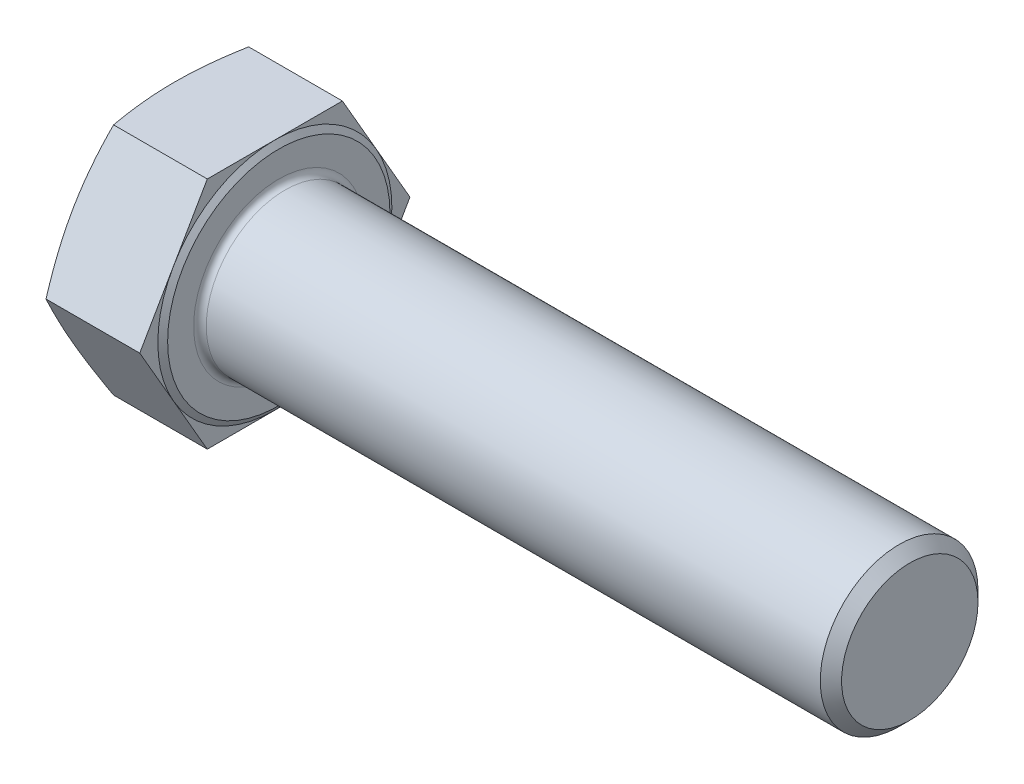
ISO-10303-21;
HEADER;
FILE_DESCRIPTION(('STEP AP214'),'2;1');
FILE_NAME('part.step','',(''),(''),'','','');
FILE_SCHEMA(('AUTOMOTIVE_DESIGN { 1 0 10303 214 1 1 1 1 }'));
ENDSEC;
DATA;
#1=APPLICATION_CONTEXT('core data for automotive mechanical design processes');
#2=APPLICATION_PROTOCOL_DEFINITION('international standard','automotive_design',2000,#1);
#3=PRODUCT_CONTEXT('',#1,'mechanical');
#4=PRODUCT('Part','Part','',(#3));
#5=PRODUCT_RELATED_PRODUCT_CATEGORY('part','',(#4));
#6=PRODUCT_DEFINITION_FORMATION('','',#4);
#7=PRODUCT_DEFINITION_CONTEXT('part definition',#1,'design');
#8=PRODUCT_DEFINITION('design','',#6,#7);
#9=PRODUCT_DEFINITION_SHAPE('','',#8);
#10=(LENGTH_UNIT() NAMED_UNIT(*) SI_UNIT(.MILLI.,.METRE.));
#11=(NAMED_UNIT(*) PLANE_ANGLE_UNIT() SI_UNIT($,.RADIAN.));
#12=(NAMED_UNIT(*) SI_UNIT($,.STERADIAN.) SOLID_ANGLE_UNIT());
#13=UNCERTAINTY_MEASURE_WITH_UNIT(LENGTH_MEASURE(1.E-05),#10,'distance_accuracy_value','');
#14=(GEOMETRIC_REPRESENTATION_CONTEXT(3) GLOBAL_UNCERTAINTY_ASSIGNED_CONTEXT((#13)) GLOBAL_UNIT_ASSIGNED_CONTEXT((#10,
#11,#12)) REPRESENTATION_CONTEXT('',''));
#15=CARTESIAN_POINT('',(0.,0.,0.));
#16=DIRECTION('',(0.,0.,1.));
#17=DIRECTION('',(1.,0.,0.));
#18=AXIS2_PLACEMENT_3D('',#15,#16,#17);
#19=CARTESIAN_POINT('',(13.22,0.,0.));
#20=DIRECTION('',(1.,0.,0.));
#21=DIRECTION('',(0.,0.,-1.));
#22=AXIS2_PLACEMENT_3D('',#19,#20,#21);
#23=PLANE('',#22);
#24=CARTESIAN_POINT('',(13.22,0.,0.));
#25=DIRECTION('',(1.,0.,0.));
#26=DIRECTION('',(0.,0.,-1.));
#27=AXIS2_PLACEMENT_3D('',#24,#25,#26);
#28=CIRCLE('',#27,10.8);
#29=CARTESIAN_POINT('',(13.22,0.,-10.8));
#30=VERTEX_POINT('',#29);
#31=EDGE_CURVE('E188',#30,#30,#28,.F.);
#32=ORIENTED_EDGE('',*,*,#31,.T.);
#33=EDGE_LOOP('',(#32));
#34=FACE_BOUND('',#33,.T.);
#35=CARTESIAN_POINT('',(13.22,0.,0.));
#36=DIRECTION('',(-1.,0.,0.));
#37=DIRECTION('',(0.,0.,1.));
#38=AXIS2_PLACEMENT_3D('',#35,#36,#37);
#39=CIRCLE('',#38,14.095);
#40=CARTESIAN_POINT('',(13.22,0.,14.095));
#41=VERTEX_POINT('',#40);
#42=EDGE_CURVE('E139',#41,#41,#39,.T.);
#43=ORIENTED_EDGE('',*,*,#42,.F.);
#44=EDGE_LOOP('',(#43));
#45=FACE_BOUND('',#44,.T.);
#46=ADVANCED_FACE('F33',(#34,#45),#23,.T.);
#47=CARTESIAN_POINT('',(12.72,0.,-17.1299824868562));
#48=DIRECTION('',(1.,0.,0.));
#49=DIRECTION('',(0.,0.,-1.));
#50=AXIS2_PLACEMENT_3D('',#47,#48,#49);
#51=PLANE('',#50);
#52=DIRECTION('',(0.,-0.866025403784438,0.5));
#53=VECTOR('',#52,1.);
#54=CARTESIAN_POINT('',(12.72,14.835,8.56499124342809));
#55=LINE('',#54,#53);
#56=CARTESIAN_POINT('',(12.72,14.835,8.56499124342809));
#57=VERTEX_POINT('',#56);
#58=CARTESIAN_POINT('',(12.72,7.4175,12.8474868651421));
#59=VERTEX_POINT('',#58);
#60=EDGE_CURVE('E138',#57,#59,#55,.T.);
#61=ORIENTED_EDGE('',*,*,#60,.T.);
#62=CARTESIAN_POINT('',(12.72,0.,0.));
#63=DIRECTION('',(-1.,0.,0.));
#64=DIRECTION('',(0.,0.,1.));
#65=AXIS2_PLACEMENT_3D('',#62,#63,#64);
#66=CIRCLE('',#65,14.835);
#67=CARTESIAN_POINT('',(12.72,14.835,0.));
#68=VERTEX_POINT('',#67);
#69=EDGE_CURVE('E49',#59,#68,#66,.T.);
#70=ORIENTED_EDGE('',*,*,#69,.T.);
#71=DIRECTION('',(0.,0.,1.));
#72=VECTOR('',#71,1.);
#73=CARTESIAN_POINT('',(12.72,14.835,-8.56499124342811));
#74=LINE('',#73,#72);
#75=EDGE_CURVE('E135',#68,#57,#74,.T.);
#76=ORIENTED_EDGE('',*,*,#75,.T.);
#77=EDGE_LOOP('',(#61,#70,#76));
#78=FACE_BOUND('',#77,.T.);
#79=ADVANCED_FACE('F134',(#78),#51,.T.);
#80=CARTESIAN_POINT('',(12.72,14.835,-8.56499124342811));
#81=VERTEX_POINT('',#80);
#82=EDGE_CURVE('E145',#81,#68,#74,.T.);
#83=ORIENTED_EDGE('',*,*,#82,.T.);
#84=CARTESIAN_POINT('',(12.72,7.4175,-12.8474868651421));
#85=VERTEX_POINT('',#84);
#86=EDGE_CURVE('E122',#68,#85,#66,.T.);
#87=ORIENTED_EDGE('',*,*,#86,.T.);
#88=DIRECTION('',(0.,0.866025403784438,0.5));
#89=VECTOR('',#88,1.);
#90=CARTESIAN_POINT('',(12.72,0.,-17.1299824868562));
#91=LINE('',#90,#89);
#92=EDGE_CURVE('E151',#85,#81,#91,.T.);
#93=ORIENTED_EDGE('',*,*,#92,.T.);
#94=EDGE_LOOP('',(#83,#87,#93));
#95=FACE_BOUND('',#94,.T.);
#96=ADVANCED_FACE('F150',(#95),#51,.T.);
#97=CARTESIAN_POINT('',(12.72,0.,-17.1299824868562));
#98=VERTEX_POINT('',#97);
#99=EDGE_CURVE('E148',#98,#85,#91,.T.);
#100=ORIENTED_EDGE('',*,*,#99,.T.);
#101=CARTESIAN_POINT('',(12.72,-7.4175,-12.8474868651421));
#102=VERTEX_POINT('',#101);
#103=EDGE_CURVE('E125',#85,#102,#66,.T.);
#104=ORIENTED_EDGE('',*,*,#103,.T.);
#105=DIRECTION('',(0.,0.866025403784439,-0.5));
#106=VECTOR('',#105,1.);
#107=CARTESIAN_POINT('',(12.72,-14.835,-8.56499124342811));
#108=LINE('',#107,#106);
#109=EDGE_CURVE('E306',#102,#98,#108,.T.);
#110=ORIENTED_EDGE('',*,*,#109,.T.);
#111=EDGE_LOOP('',(#100,#104,#110));
#112=FACE_BOUND('',#111,.T.);
#113=ADVANCED_FACE('F337',(#112),#51,.T.);
#114=CARTESIAN_POINT('',(12.72,-14.835,-8.56499124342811));
#115=VERTEX_POINT('',#114);
#116=EDGE_CURVE('E304',#115,#102,#108,.T.);
#117=ORIENTED_EDGE('',*,*,#116,.T.);
#118=CARTESIAN_POINT('',(12.72,-14.835,0.));
#119=VERTEX_POINT('',#118);
#120=EDGE_CURVE('E338',#102,#119,#66,.T.);
#121=ORIENTED_EDGE('',*,*,#120,.T.);
#122=DIRECTION('',(0.,0.,-1.));
#123=VECTOR('',#122,1.);
#124=CARTESIAN_POINT('',(12.72,-14.835,8.56499124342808));
#125=LINE('',#124,#123);
#126=EDGE_CURVE('E162',#119,#115,#125,.T.);
#127=ORIENTED_EDGE('',*,*,#126,.T.);
#128=EDGE_LOOP('',(#117,#121,#127));
#129=FACE_BOUND('',#128,.T.);
#130=ADVANCED_FACE('F352',(#129),#51,.T.);
#131=CARTESIAN_POINT('',(12.72,-14.835,8.56499124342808));
#132=VERTEX_POINT('',#131);
#133=EDGE_CURVE('E163',#132,#119,#125,.T.);
#134=ORIENTED_EDGE('',*,*,#133,.T.);
#135=CARTESIAN_POINT('',(12.72,-7.4175,12.8474868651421));
#136=VERTEX_POINT('',#135);
#137=EDGE_CURVE('E339',#119,#136,#66,.T.);
#138=ORIENTED_EDGE('',*,*,#137,.T.);
#139=DIRECTION('',(0.,-0.866025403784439,-0.5));
#140=VECTOR('',#139,1.);
#141=CARTESIAN_POINT('',(12.72,0.,17.1299824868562));
#142=LINE('',#141,#140);
#143=EDGE_CURVE('E158',#136,#132,#142,.T.);
#144=ORIENTED_EDGE('',*,*,#143,.T.);
#145=EDGE_LOOP('',(#134,#138,#144));
#146=FACE_BOUND('',#145,.T.);
#147=ADVANCED_FACE('F347',(#146),#51,.T.);
#148=CARTESIAN_POINT('',(12.72,0.,17.1299824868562));
#149=VERTEX_POINT('',#148);
#150=EDGE_CURVE('E159',#149,#136,#142,.T.);
#151=ORIENTED_EDGE('',*,*,#150,.T.);
#152=EDGE_CURVE('E140',#136,#59,#66,.T.);
#153=ORIENTED_EDGE('',*,*,#152,.T.);
#154=EDGE_CURVE('E153',#59,#149,#55,.T.);
#155=ORIENTED_EDGE('',*,*,#154,.T.);
#156=EDGE_LOOP('',(#151,#153,#155));
#157=FACE_BOUND('',#156,.T.);
#158=ADVANCED_FACE('F213',(#157),#51,.T.);
#159=CARTESIAN_POINT('',(12.72,-14.835,-8.56499124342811));
#160=DIRECTION('',(0.,0.5,0.866025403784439));
#161=DIRECTION('',(0.,-0.866025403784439,0.5));
#162=AXIS2_PLACEMENT_3D('',#159,#160,#161);
#163=PLANE('',#162);
#164=CARTESIAN_POINT('',(0.835347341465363,0.000199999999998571,-17.13009795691));
#165=CARTESIAN_POINT('',(0.770791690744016,-0.307026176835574,-16.9527208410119));
#166=CARTESIAN_POINT('',(0.709139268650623,-0.614703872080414,-16.7750830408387));
#167=CARTESIAN_POINT('',(0.592279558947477,-1.2310042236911,-16.4192618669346));
#168=CARTESIAN_POINT('',(0.537072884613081,-1.53962696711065,-16.2410784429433));
#169=CARTESIAN_POINT('',(0.382025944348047,-2.46731519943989,-15.7054773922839));
#170=CARTESIAN_POINT('',(0.292849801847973,-3.08777597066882,-15.3472541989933));
#171=CARTESIAN_POINT('',(0.184472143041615,-4.01768849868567,-14.81036895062));
#172=CARTESIAN_POINT('',(0.152669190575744,-4.32606735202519,-14.632326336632));
#173=CARTESIAN_POINT('',(0.0977478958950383,-4.94340084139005,-14.2759086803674));
#174=CARTESIAN_POINT('',(0.0746291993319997,-5.25235545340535,-14.097533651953));
#175=CARTESIAN_POINT('',(0.0374802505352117,-5.87056890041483,-13.7406079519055));
#176=CARTESIAN_POINT('',(0.0234468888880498,-6.17982759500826,-13.5620573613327));
#177=CARTESIAN_POINT('',(0.00470677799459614,-6.79855752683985,-13.2048334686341));
#178=CARTESIAN_POINT('',(0.,-7.10802876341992,-13.0261601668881));
#179=CARTESIAN_POINT('',(0.,-7.72697123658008,-12.6688135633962));
#180=CARTESIAN_POINT('',(0.00470677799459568,-8.03644247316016,-12.4901402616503));
#181=CARTESIAN_POINT('',(0.0234468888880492,-8.65517240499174,-12.1329163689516));
#182=CARTESIAN_POINT('',(0.0374802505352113,-8.96443109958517,-11.9543657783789));
#183=CARTESIAN_POINT('',(0.074629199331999,-9.58264454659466,-11.5974400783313));
#184=CARTESIAN_POINT('',(0.0977478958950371,-9.89159915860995,-11.4190650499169));
#185=CARTESIAN_POINT('',(0.152669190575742,-10.5089326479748,-11.0626473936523));
#186=CARTESIAN_POINT('',(0.184472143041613,-10.8173115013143,-10.8846047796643));
#187=CARTESIAN_POINT('',(0.292849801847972,-11.7472240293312,-10.347719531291));
#188=CARTESIAN_POINT('',(0.382025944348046,-12.3676848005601,-9.98949633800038));
#189=CARTESIAN_POINT('',(0.53707288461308,-13.2953730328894,-9.45389528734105));
#190=CARTESIAN_POINT('',(0.592279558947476,-13.6039957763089,-9.27571186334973));
#191=CARTESIAN_POINT('',(0.709139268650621,-14.2202961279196,-8.91989068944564));
#192=CARTESIAN_POINT('',(0.770791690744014,-14.5279738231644,-8.74225288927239));
#193=CARTESIAN_POINT('',(0.835347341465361,-14.8352,-8.56487577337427));
#194=B_SPLINE_CURVE_WITH_KNOTS('',3,(#164,#165,#166,#167,#168,#169,#170,#171,#172,#173,#174,
#175,#176,#177,#178,#179,#180,#181,#182,#183,#184,#185,#186,#187,#188,#189,#190,#191,#192,#193),
.UNSPECIFIED.,.F.,.F.,(4,2,2,2,2,2,2,2,2,2,2,2,2,2,4),(0.,1.08170811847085,2.16351907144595,
4.32863649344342,5.40105974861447,6.47343924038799,7.54545152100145,8.61746049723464,
9.68946947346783,10.7614817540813,11.8338612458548,12.9062845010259,15.0714019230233,
16.1532128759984,17.2349209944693),.UNSPECIFIED.);
#195=CARTESIAN_POINT('',(0.835305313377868,0.,-17.1299824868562));
#196=VERTEX_POINT('',#195);
#197=CARTESIAN_POINT('',(0.,-7.4175,-12.8474868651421));
#198=VERTEX_POINT('',#197);
#199=EDGE_CURVE('E321',#196,#198,#194,.T.);
#200=ORIENTED_EDGE('',*,*,#199,.F.);
#201=DIRECTION('',(-1.,0.,0.));
#202=VECTOR('',#201,1.);
#203=CARTESIAN_POINT('',(12.72,0.,-17.1299824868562));
#204=LINE('',#203,#202);
#205=EDGE_CURVE('E178',#98,#196,#204,.T.);
#206=ORIENTED_EDGE('',*,*,#205,.F.);
#207=ORIENTED_EDGE('',*,*,#109,.F.);
#208=ORIENTED_EDGE('',*,*,#116,.F.);
#209=DIRECTION('',(-1.,0.,0.));
#210=VECTOR('',#209,1.);
#211=CARTESIAN_POINT('',(12.72,-14.835,-8.56499124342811));
#212=LINE('',#211,#210);
#213=CARTESIAN_POINT('',(0.835305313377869,-14.835,-8.56499124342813));
#214=VERTEX_POINT('',#213);
#215=EDGE_CURVE('E166',#115,#214,#212,.T.);
#216=ORIENTED_EDGE('',*,*,#215,.T.);
#217=EDGE_CURVE('E246',#198,#214,#194,.T.);
#218=ORIENTED_EDGE('',*,*,#217,.F.);
#219=EDGE_LOOP('',(#200,#206,#207,#208,#216,#218));
#220=FACE_BOUND('',#219,.T.);
#221=ADVANCED_FACE('F35',(#220),#163,.F.);
#222=CARTESIAN_POINT('',(12.72,0.,-17.1299824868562));
#223=DIRECTION('',(0.,-0.5,0.866025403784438));
#224=DIRECTION('',(0.,-0.866025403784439,-0.5));
#225=AXIS2_PLACEMENT_3D('',#222,#223,#224);
#226=PLANE('',#225);
#227=CARTESIAN_POINT('',(0.835347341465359,14.8352,-8.56487577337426));
#228=CARTESIAN_POINT('',(0.770791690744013,14.5279738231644,-8.74225288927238));
#229=CARTESIAN_POINT('',(0.70913926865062,14.2202961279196,-8.91989068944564));
#230=CARTESIAN_POINT('',(0.592279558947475,13.6039957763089,-9.27571186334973));
#231=CARTESIAN_POINT('',(0.537072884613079,13.2953730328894,-9.45389528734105));
#232=CARTESIAN_POINT('',(0.382025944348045,12.3676848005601,-9.98949633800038));
#233=CARTESIAN_POINT('',(0.29284980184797,11.7472240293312,-10.347719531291));
#234=CARTESIAN_POINT('',(0.184472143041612,10.8173115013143,-10.8846047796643));
#235=CARTESIAN_POINT('',(0.152669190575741,10.5089326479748,-11.0626473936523));
#236=CARTESIAN_POINT('',(0.0977478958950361,9.89159915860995,-11.4190650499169));
#237=CARTESIAN_POINT('',(0.0746291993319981,9.58264454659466,-11.5974400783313));
#238=CARTESIAN_POINT('',(0.0374802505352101,8.96443109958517,-11.9543657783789));
#239=CARTESIAN_POINT('',(0.0234468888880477,8.65517240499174,-12.1329163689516));
#240=CARTESIAN_POINT('',(0.00470677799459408,8.03644247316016,-12.4901402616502));
#241=CARTESIAN_POINT('',(0.,7.72697123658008,-12.6688135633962));
#242=CARTESIAN_POINT('',(0.,7.10802876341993,-13.0261601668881));
#243=CARTESIAN_POINT('',(0.00470677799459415,6.79855752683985,-13.2048334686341));
#244=CARTESIAN_POINT('',(0.023446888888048,6.17982759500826,-13.5620573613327));
#245=CARTESIAN_POINT('',(0.0374802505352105,5.87056890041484,-13.7406079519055));
#246=CARTESIAN_POINT('',(0.0746291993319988,5.25235545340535,-14.097533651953));
#247=CARTESIAN_POINT('',(0.0977478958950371,4.94340084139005,-14.2759086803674));
#248=CARTESIAN_POINT('',(0.152669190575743,4.32606735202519,-14.632326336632));
#249=CARTESIAN_POINT('',(0.184472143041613,4.01768849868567,-14.81036895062));
#250=CARTESIAN_POINT('',(0.292849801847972,3.08777597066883,-15.3472541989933));
#251=CARTESIAN_POINT('',(0.382025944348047,2.46731519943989,-15.7054773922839));
#252=CARTESIAN_POINT('',(0.537072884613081,1.53962696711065,-16.2410784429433));
#253=CARTESIAN_POINT('',(0.592279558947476,1.2310042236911,-16.4192618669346));
#254=CARTESIAN_POINT('',(0.709139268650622,0.614703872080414,-16.7750830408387));
#255=CARTESIAN_POINT('',(0.770791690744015,0.307026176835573,-16.9527208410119));
#256=CARTESIAN_POINT('',(0.835347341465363,-0.000199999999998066,-17.13009795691));
#257=B_SPLINE_CURVE_WITH_KNOTS('',3,(#227,#228,#229,#230,#231,#232,#233,#234,#235,#236,#237,
#238,#239,#240,#241,#242,#243,#244,#245,#246,#247,#248,#249,#250,#251,#252,#253,#254,#255,#256),
.UNSPECIFIED.,.F.,.F.,(4,2,2,2,2,2,2,2,2,2,2,2,2,2,4),(0.,1.08170811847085,2.16351907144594,
4.32863649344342,5.40105974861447,6.47343924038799,7.54545152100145,8.61746049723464,
9.68946947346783,10.7614817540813,11.8338612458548,12.9062845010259,15.0714019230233,
16.1532128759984,17.2349209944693),.UNSPECIFIED.);
#258=CARTESIAN_POINT('',(0.835305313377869,14.835,-8.56499124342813));
#259=VERTEX_POINT('',#258);
#260=CARTESIAN_POINT('',(0.,7.4175,-12.8474868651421));
#261=VERTEX_POINT('',#260);
#262=EDGE_CURVE('E261',#259,#261,#257,.T.);
#263=ORIENTED_EDGE('',*,*,#262,.F.);
#264=DIRECTION('',(-1.,0.,0.));
#265=VECTOR('',#264,1.);
#266=CARTESIAN_POINT('',(12.72,14.835,-8.56499124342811));
#267=LINE('',#266,#265);
#268=EDGE_CURVE('E176',#81,#259,#267,.T.);
#269=ORIENTED_EDGE('',*,*,#268,.F.);
#270=ORIENTED_EDGE('',*,*,#92,.F.);
#271=ORIENTED_EDGE('',*,*,#99,.F.);
#272=ORIENTED_EDGE('',*,*,#205,.T.);
#273=EDGE_CURVE('E257',#261,#196,#257,.T.);
#274=ORIENTED_EDGE('',*,*,#273,.F.);
#275=EDGE_LOOP('',(#263,#269,#270,#271,#272,#274));
#276=FACE_BOUND('',#275,.T.);
#277=ADVANCED_FACE('F267',(#276),#226,.F.);
#278=CARTESIAN_POINT('',(12.72,14.835,-8.56499124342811));
#279=DIRECTION('',(0.,-1.,0.));
#280=DIRECTION('',(0.,0.,-1.));
#281=AXIS2_PLACEMENT_3D('',#278,#279,#280);
#282=PLANE('',#281);
#283=CARTESIAN_POINT('',(4.46354033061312,14.835,-22.6770851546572));
#284=CARTESIAN_POINT('',(4.36132694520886,14.835,-22.3414955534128));
#285=CARTESIAN_POINT('',(4.25973169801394,14.835,-22.0057177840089));
#286=CARTESIAN_POINT('',(4.05791586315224,14.835,-21.3337473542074));
#287=CARTESIAN_POINT('',(3.95769528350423,14.835,-20.997554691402));
#288=CARTESIAN_POINT('',(3.65929019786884,14.835,-19.988252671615));
#289=CARTESIAN_POINT('',(3.46337749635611,14.835,-19.3144688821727));
#290=CARTESIAN_POINT('',(3.07864714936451,14.835,-17.9635142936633));
#291=CARTESIAN_POINT('',(2.88984342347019,14.835,-17.2863395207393));
#292=CARTESIAN_POINT('',(2.52152523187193,14.835,-15.9294713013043));
#293=CARTESIAN_POINT('',(2.34201059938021,14.835,-15.249777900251));
#294=CARTESIAN_POINT('',(1.99671819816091,14.835,-13.8958180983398));
#295=CARTESIAN_POINT('',(1.830798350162,14.835,-13.2215881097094));
#296=CARTESIAN_POINT('',(1.51308451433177,14.835,-11.8697731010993));
#297=CARTESIAN_POINT('',(1.36129076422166,14.835,-11.1921880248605));
#298=CARTESIAN_POINT('',(1.07536835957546,14.835,-9.83351119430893));
#299=CARTESIAN_POINT('',(0.941233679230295,14.835,-9.15242071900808));
#300=CARTESIAN_POINT('',(0.694713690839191,14.835,-7.78628556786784));
#301=CARTESIAN_POINT('',(0.582327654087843,14.835,-7.10124102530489));
#302=CARTESIAN_POINT('',(0.394998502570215,14.835,-5.80433644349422));
#303=CARTESIAN_POINT('',(0.317270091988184,14.835,-5.19288250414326));
#304=CARTESIAN_POINT('',(0.185694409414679,14.835,-3.96738909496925));
#305=CARTESIAN_POINT('',(0.131846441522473,14.835,-3.35334970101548));
#306=CARTESIAN_POINT('',(0.050624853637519,14.835,-2.12393088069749));
#307=CARTESIAN_POINT('',(0.0232325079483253,14.835,-1.50855271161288));
#308=CARTESIAN_POINT('',(-0.00369096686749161,14.835,-0.27718070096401));
#309=CARTESIAN_POINT('',(-0.00322229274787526,14.835,0.338813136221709));
#310=CARTESIAN_POINT('',(0.0256237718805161,14.835,1.57326186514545));
#311=CARTESIAN_POINT('',(0.0541426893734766,14.835,2.19171339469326));
#312=CARTESIAN_POINT('',(0.137776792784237,14.835,3.42679990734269));
#313=CARTESIAN_POINT('',(0.19289261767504,14.835,4.04343484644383));
#314=CARTESIAN_POINT('',(0.32714224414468,14.835,5.27458369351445));
#315=CARTESIAN_POINT('',(0.406296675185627,14.835,5.88909531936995));
#316=CARTESIAN_POINT('',(0.585412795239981,14.835,7.11504431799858));
#317=CARTESIAN_POINT('',(0.685374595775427,14.835,7.72648167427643));
#318=CARTESIAN_POINT('',(0.908604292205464,14.835,8.97845707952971));
#319=CARTESIAN_POINT('',(1.03282528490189,14.835,9.61882367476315));
#320=CARTESIAN_POINT('',(1.2972552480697,14.835,10.8962684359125));
#321=CARTESIAN_POINT('',(1.4374654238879,14.835,11.5333463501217));
#322=CARTESIAN_POINT('',(1.73092962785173,14.835,12.8046677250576));
#323=CARTESIAN_POINT('',(1.88418744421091,14.835,13.4389103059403));
#324=CARTESIAN_POINT('',(2.2012538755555,14.835,14.7047236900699));
#325=CARTESIAN_POINT('',(2.36506223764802,14.835,15.3362945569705));
#326=CARTESIAN_POINT('',(2.70147349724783,14.835,16.5979501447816));
#327=CARTESIAN_POINT('',(2.87408741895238,14.835,17.2280319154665));
#328=CARTESIAN_POINT('',(3.22633703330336,14.835,18.4862269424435));
#329=CARTESIAN_POINT('',(3.40597275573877,14.835,19.1143401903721));
#330=CARTESIAN_POINT('',(3.77098067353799,14.835,20.3687797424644));
#331=CARTESIAN_POINT('',(3.95635190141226,14.835,20.995106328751));
#332=CARTESIAN_POINT('',(4.33186328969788,14.835,22.2463243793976));
#333=CARTESIAN_POINT('',(4.52200343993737,14.835,22.8712158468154));
#334=CARTESIAN_POINT('',(4.90413575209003,14.835,24.1128810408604));
#335=CARTESIAN_POINT('',(5.09608428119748,14.835,24.7296682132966));
#336=CARTESIAN_POINT('',(5.4832549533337,14.835,25.9622149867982));
#337=CARTESIAN_POINT('',(5.67847710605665,14.835,26.5779745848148));
#338=CARTESIAN_POINT('',(6.26829610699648,14.835,28.42398494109));
#339=CARTESIAN_POINT('',(6.66702905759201,14.835,29.6529141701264));
#340=CARTESIAN_POINT('',(7.47100797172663,14.835,32.1034680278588));
#341=CARTESIAN_POINT('',(7.876223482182,14.835,33.3251026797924));
#342=CARTESIAN_POINT('',(8.48854586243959,14.835,35.1559925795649));
#343=CARTESIAN_POINT('',(8.69339483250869,14.835,35.7660043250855));
#344=CARTESIAN_POINT('',(9.1044182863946,14.835,36.9855795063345));
#345=CARTESIAN_POINT('',(9.31059276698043,14.835,37.5951429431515));
#346=CARTESIAN_POINT('',(9.51734078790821,14.835,38.2045116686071));
#347=B_SPLINE_CURVE_WITH_KNOTS('',3,(#283,#284,#285,#286,#287,#288,#289,#290,#291,#292,#293,
#294,#295,#296,#297,#298,#299,#300,#301,#302,#303,#304,#305,#306,#307,#308,#309,#310,#311,#312,
#313,#314,#315,#316,#317,#318,#319,#320,#321,#322,#323,#324,#325,#326,#327,#328,#329,#330,#331,
#332,#333,#334,#335,#336,#337,#338,#339,#340,#341,#342,#343,#344,#345,#346),.UNSPECIFIED.,.F.,
.F.,(4,2,2,2,2,2,2,2,2,2,2,2,2,2,2,2,2,2,2,2,2,2,2,2,2,2,2,2,2,2,2,4),(0.,1.05243016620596,
2.10486646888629,4.20989465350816,6.31885029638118,8.4277680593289,10.5106839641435,
12.593634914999,14.6758732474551,16.7580418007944,18.6067595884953,20.4554234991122,
22.3027779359,24.1501193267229,26.0068295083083,27.8635842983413,29.7219370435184,
31.5802997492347,33.5369608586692,35.4937695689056,37.4511483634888,39.4084802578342,
41.3683258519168,43.3281797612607,45.2877048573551,47.2472257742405,49.1851096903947,
51.1229993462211,54.9989453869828,58.8601847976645,60.7906489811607,62.7211084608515),.UNSPECIFIED.);
#348=CARTESIAN_POINT('',(0.835305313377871,14.835,8.56499124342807));
#349=VERTEX_POINT('',#348);
#350=CARTESIAN_POINT('',(0.,14.835,0.));
#351=VERTEX_POINT('',#350);
#352=EDGE_CURVE('E57',#349,#351,#347,.F.);
#353=ORIENTED_EDGE('',*,*,#352,.F.);
#354=DIRECTION('',(-1.,0.,0.));
#355=VECTOR('',#354,1.);
#356=CARTESIAN_POINT('',(12.72,14.835,8.56499124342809));
#357=LINE('',#356,#355);
#358=EDGE_CURVE('E147',#57,#349,#357,.T.);
#359=ORIENTED_EDGE('',*,*,#358,.F.);
#360=ORIENTED_EDGE('',*,*,#75,.F.);
#361=ORIENTED_EDGE('',*,*,#82,.F.);
#362=ORIENTED_EDGE('',*,*,#268,.T.);
#363=EDGE_CURVE('E262',#351,#259,#347,.F.);
#364=ORIENTED_EDGE('',*,*,#363,.F.);
#365=EDGE_LOOP('',(#353,#359,#360,#361,#362,#364));
#366=FACE_BOUND('',#365,.T.);
#367=ADVANCED_FACE('F143',(#366),#282,.F.);
#368=CARTESIAN_POINT('',(12.72,14.835,8.56499124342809));
#369=DIRECTION('',(0.,-0.5,-0.866025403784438));
#370=DIRECTION('',(0.,0.866025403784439,-0.5));
#371=AXIS2_PLACEMENT_3D('',#368,#369,#370);
#372=PLANE('',#371);
#373=CARTESIAN_POINT('',(0.835347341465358,-0.000199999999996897,17.13009795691));
#374=CARTESIAN_POINT('',(0.77079169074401,0.307026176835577,16.9527208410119));
#375=CARTESIAN_POINT('',(0.709139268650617,0.614703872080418,16.7750830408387));
#376=CARTESIAN_POINT('',(0.592279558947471,1.2310042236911,16.4192618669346));
#377=CARTESIAN_POINT('',(0.537072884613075,1.53962696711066,16.2410784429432));
#378=CARTESIAN_POINT('',(0.382025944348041,2.46731519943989,15.7054773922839));
#379=CARTESIAN_POINT('',(0.292849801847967,3.08777597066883,15.3472541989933));
#380=CARTESIAN_POINT('',(0.184472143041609,4.01768849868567,14.81036895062));
#381=CARTESIAN_POINT('',(0.152669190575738,4.32606735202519,14.632326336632));
#382=CARTESIAN_POINT('',(0.0977478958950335,4.94340084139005,14.2759086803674));
#383=CARTESIAN_POINT('',(0.0746291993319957,5.25235545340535,14.097533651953));
#384=CARTESIAN_POINT('',(0.0374802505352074,5.87056890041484,13.7406079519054));
#385=CARTESIAN_POINT('',(0.0234468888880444,6.17982759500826,13.5620573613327));
#386=CARTESIAN_POINT('',(0.00470677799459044,6.79855752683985,13.204833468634));
#387=CARTESIAN_POINT('',(0.,7.10802876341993,13.0261601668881));
#388=CARTESIAN_POINT('',(0.,7.72697123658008,12.6688135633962));
#389=CARTESIAN_POINT('',(0.00470677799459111,8.03644247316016,12.4901402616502));
#390=CARTESIAN_POINT('',(0.0234468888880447,8.65517240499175,12.1329163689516));
#391=CARTESIAN_POINT('',(0.0374802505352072,8.96443109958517,11.9543657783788));
#392=CARTESIAN_POINT('',(0.0746291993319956,9.58264454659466,11.5974400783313));
#393=CARTESIAN_POINT('',(0.097747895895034,9.89159915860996,11.4190650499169));
#394=CARTESIAN_POINT('',(0.152669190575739,10.5089326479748,11.0626473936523));
#395=CARTESIAN_POINT('',(0.18447214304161,10.8173115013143,10.8846047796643));
#396=CARTESIAN_POINT('',(0.292849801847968,11.7472240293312,10.347719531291));
#397=CARTESIAN_POINT('',(0.382025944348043,12.3676848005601,9.98949633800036));
#398=CARTESIAN_POINT('',(0.537072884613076,13.2953730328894,9.45389528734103));
#399=CARTESIAN_POINT('',(0.592279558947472,13.6039957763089,9.27571186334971));
#400=CARTESIAN_POINT('',(0.709139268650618,14.2202961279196,8.91989068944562));
#401=CARTESIAN_POINT('',(0.770791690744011,14.5279738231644,8.74225288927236));
#402=CARTESIAN_POINT('',(0.835347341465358,14.8352,8.56487577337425));
#403=B_SPLINE_CURVE_WITH_KNOTS('',3,(#373,#374,#375,#376,#377,#378,#379,#380,#381,#382,#383,
#384,#385,#386,#387,#388,#389,#390,#391,#392,#393,#394,#395,#396,#397,#398,#399,#400,#401,#402),
.UNSPECIFIED.,.F.,.F.,(4,2,2,2,2,2,2,2,2,2,2,2,2,2,4),(0.,1.08170811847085,2.16351907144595,
4.32863649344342,5.40105974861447,6.47343924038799,7.54545152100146,8.61746049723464,
9.68946947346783,10.7614817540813,11.8338612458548,12.9062845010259,15.0714019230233,
16.1532128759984,17.2349209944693),.UNSPECIFIED.);
#404=CARTESIAN_POINT('',(0.835305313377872,0.,17.1299824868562));
#405=VERTEX_POINT('',#404);
#406=CARTESIAN_POINT('',(0.,7.41750000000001,12.8474868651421));
#407=VERTEX_POINT('',#406);
#408=EDGE_CURVE('E251',#405,#407,#403,.T.);
#409=ORIENTED_EDGE('',*,*,#408,.F.);
#410=DIRECTION('',(-1.,0.,0.));
#411=VECTOR('',#410,1.);
#412=CARTESIAN_POINT('',(12.72,0.,17.1299824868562));
#413=LINE('',#412,#411);
#414=EDGE_CURVE('E172',#149,#405,#413,.T.);
#415=ORIENTED_EDGE('',*,*,#414,.F.);
#416=ORIENTED_EDGE('',*,*,#154,.F.);
#417=ORIENTED_EDGE('',*,*,#60,.F.);
#418=ORIENTED_EDGE('',*,*,#358,.T.);
#419=EDGE_CURVE('E312',#407,#349,#403,.T.);
#420=ORIENTED_EDGE('',*,*,#419,.F.);
#421=EDGE_LOOP('',(#409,#415,#416,#417,#418,#420));
#422=FACE_BOUND('',#421,.T.);
#423=ADVANCED_FACE('F273',(#422),#372,.F.);
#424=CARTESIAN_POINT('',(12.72,0.,17.1299824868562));
#425=DIRECTION('',(0.,0.5,-0.866025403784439));
#426=DIRECTION('',(0.,0.866025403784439,0.5));
#427=AXIS2_PLACEMENT_3D('',#424,#425,#426);
#428=PLANE('',#427);
#429=CARTESIAN_POINT('',(0.835347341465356,-14.8352,8.56487577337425));
#430=CARTESIAN_POINT('',(0.770791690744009,-14.5279738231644,8.74225288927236));
#431=CARTESIAN_POINT('',(0.709139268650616,-14.2202961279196,8.91989068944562));
#432=CARTESIAN_POINT('',(0.592279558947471,-13.6039957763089,9.27571186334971));
#433=CARTESIAN_POINT('',(0.537072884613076,-13.2953730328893,9.45389528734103));
#434=CARTESIAN_POINT('',(0.382025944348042,-12.3676848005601,9.98949633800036));
#435=CARTESIAN_POINT('',(0.292849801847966,-11.7472240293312,10.347719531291));
#436=CARTESIAN_POINT('',(0.184472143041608,-10.8173115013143,10.8846047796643));
#437=CARTESIAN_POINT('',(0.152669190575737,-10.5089326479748,11.0626473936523));
#438=CARTESIAN_POINT('',(0.097747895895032,-9.89159915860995,11.4190650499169));
#439=CARTESIAN_POINT('',(0.0746291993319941,-9.58264454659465,11.5974400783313));
#440=CARTESIAN_POINT('',(0.0374802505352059,-8.96443109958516,11.9543657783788));
#441=CARTESIAN_POINT('',(0.0234468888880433,-8.65517240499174,12.1329163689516));
#442=CARTESIAN_POINT('',(0.00470677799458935,-8.03644247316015,12.4901402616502));
#443=CARTESIAN_POINT('',(0.,-7.72697123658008,12.6688135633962));
#444=CARTESIAN_POINT('',(0.,-7.10802876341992,13.0261601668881));
#445=CARTESIAN_POINT('',(0.00470677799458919,-6.79855752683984,13.204833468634));
#446=CARTESIAN_POINT('',(0.0234468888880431,-6.17982759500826,13.5620573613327));
#447=CARTESIAN_POINT('',(0.0374802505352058,-5.87056890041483,13.7406079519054));
#448=CARTESIAN_POINT('',(0.0746291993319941,-5.25235545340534,14.097533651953));
#449=CARTESIAN_POINT('',(0.097747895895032,-4.94340084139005,14.2759086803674));
#450=CARTESIAN_POINT('',(0.152669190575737,-4.32606735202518,14.632326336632));
#451=CARTESIAN_POINT('',(0.184472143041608,-4.01768849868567,14.81036895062));
#452=CARTESIAN_POINT('',(0.292849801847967,-3.08777597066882,15.3472541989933));
#453=CARTESIAN_POINT('',(0.382025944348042,-2.46731519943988,15.7054773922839));
#454=CARTESIAN_POINT('',(0.537072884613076,-1.53962696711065,16.2410784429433));
#455=CARTESIAN_POINT('',(0.592279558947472,-1.23100422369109,16.4192618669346));
#456=CARTESIAN_POINT('',(0.709139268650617,-0.614703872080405,16.7750830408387));
#457=CARTESIAN_POINT('',(0.77079169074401,-0.307026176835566,16.9527208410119));
#458=CARTESIAN_POINT('',(0.835347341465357,0.000200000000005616,17.13009795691));
#459=B_SPLINE_CURVE_WITH_KNOTS('',3,(#429,#430,#431,#432,#433,#434,#435,#436,#437,#438,#439,
#440,#441,#442,#443,#444,#445,#446,#447,#448,#449,#450,#451,#452,#453,#454,#455,#456,#457,#458),
.UNSPECIFIED.,.F.,.F.,(4,2,2,2,2,2,2,2,2,2,2,2,2,2,4),(0.,1.08170811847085,2.16351907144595,
4.32863649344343,5.40105974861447,6.473439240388,7.54545152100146,8.61746049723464,
9.68946947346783,10.7614817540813,11.8338612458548,12.9062845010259,15.0714019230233,
16.1532128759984,17.2349209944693),.UNSPECIFIED.);
#460=CARTESIAN_POINT('',(0.835305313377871,-14.835,8.56499124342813));
#461=VERTEX_POINT('',#460);
#462=CARTESIAN_POINT('',(0.,-7.41750000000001,12.8474868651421));
#463=VERTEX_POINT('',#462);
#464=EDGE_CURVE('E239',#461,#463,#459,.T.);
#465=ORIENTED_EDGE('',*,*,#464,.F.);
#466=DIRECTION('',(-1.,0.,0.));
#467=VECTOR('',#466,1.);
#468=CARTESIAN_POINT('',(12.72,-14.835,8.56499124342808));
#469=LINE('',#468,#467);
#470=EDGE_CURVE('E169',#132,#461,#469,.T.);
#471=ORIENTED_EDGE('',*,*,#470,.F.);
#472=ORIENTED_EDGE('',*,*,#143,.F.);
#473=ORIENTED_EDGE('',*,*,#150,.F.);
#474=ORIENTED_EDGE('',*,*,#414,.T.);
#475=EDGE_CURVE('E317',#463,#405,#459,.T.);
#476=ORIENTED_EDGE('',*,*,#475,.F.);
#477=EDGE_LOOP('',(#465,#471,#472,#473,#474,#476));
#478=FACE_BOUND('',#477,.T.);
#479=ADVANCED_FACE('F276',(#478),#428,.F.);
#480=CARTESIAN_POINT('',(12.72,-14.835,8.56499124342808));
#481=DIRECTION('',(0.,1.,0.));
#482=DIRECTION('',(0.,0.,1.));
#483=AXIS2_PLACEMENT_3D('',#480,#481,#482);
#484=PLANE('',#483);
#485=CARTESIAN_POINT('',(4.46354033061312,-14.835,-22.6770851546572));
#486=CARTESIAN_POINT('',(4.36132694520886,-14.835,-22.3414955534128));
#487=CARTESIAN_POINT('',(4.25973169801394,-14.835,-22.0057177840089));
#488=CARTESIAN_POINT('',(4.05791586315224,-14.835,-21.3337473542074));
#489=CARTESIAN_POINT('',(3.95769528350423,-14.835,-20.9975546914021));
#490=CARTESIAN_POINT('',(3.65929019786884,-14.835,-19.988252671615));
#491=CARTESIAN_POINT('',(3.46337749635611,-14.835,-19.3144688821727));
#492=CARTESIAN_POINT('',(3.07864714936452,-14.835,-17.9635142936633));
#493=CARTESIAN_POINT('',(2.8898434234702,-14.835,-17.2863395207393));
#494=CARTESIAN_POINT('',(2.52152523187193,-14.835,-15.9294713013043));
#495=CARTESIAN_POINT('',(2.34201059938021,-14.835,-15.249777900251));
#496=CARTESIAN_POINT('',(1.99671819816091,-14.835,-13.8958180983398));
#497=CARTESIAN_POINT('',(1.830798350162,-14.835,-13.2215881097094));
#498=CARTESIAN_POINT('',(1.51308451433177,-14.835,-11.8697731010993));
#499=CARTESIAN_POINT('',(1.36129076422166,-14.835,-11.1921880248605));
#500=CARTESIAN_POINT('',(1.07536835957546,-14.835,-9.83351119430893));
#501=CARTESIAN_POINT('',(0.941233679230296,-14.835,-9.15242071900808));
#502=CARTESIAN_POINT('',(0.694713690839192,-14.835,-7.78628556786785));
#503=CARTESIAN_POINT('',(0.582327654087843,-14.835,-7.10124102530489));
#504=CARTESIAN_POINT('',(0.394998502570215,-14.835,-5.80433644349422));
#505=CARTESIAN_POINT('',(0.317270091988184,-14.835,-5.19288250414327));
#506=CARTESIAN_POINT('',(0.185694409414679,-14.835,-3.96738909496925));
#507=CARTESIAN_POINT('',(0.131846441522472,-14.835,-3.35334970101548));
#508=CARTESIAN_POINT('',(0.0506248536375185,-14.835,-2.12393088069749));
#509=CARTESIAN_POINT('',(0.0232325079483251,-14.835,-1.50855271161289));
#510=CARTESIAN_POINT('',(-0.00369096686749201,-14.835,-0.277180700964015));
#511=CARTESIAN_POINT('',(-0.00322229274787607,-14.835,0.338813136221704));
#512=CARTESIAN_POINT('',(0.0256237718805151,-14.835,1.57326186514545));
#513=CARTESIAN_POINT('',(0.0541426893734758,-14.835,2.19171339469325));
#514=CARTESIAN_POINT('',(0.137776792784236,-14.835,3.42679990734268));
#515=CARTESIAN_POINT('',(0.192892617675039,-14.835,4.04343484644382));
#516=CARTESIAN_POINT('',(0.327142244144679,-14.835,5.27458369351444));
#517=CARTESIAN_POINT('',(0.406296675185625,-14.835,5.88909531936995));
#518=CARTESIAN_POINT('',(0.585412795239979,-14.835,7.11504431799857));
#519=CARTESIAN_POINT('',(0.685374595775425,-14.835,7.72648167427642));
#520=CARTESIAN_POINT('',(0.908604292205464,-14.835,8.97845707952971));
#521=CARTESIAN_POINT('',(1.03282528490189,-14.835,9.61882367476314));
#522=CARTESIAN_POINT('',(1.2972552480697,-14.835,10.8962684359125));
#523=CARTESIAN_POINT('',(1.4374654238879,-14.835,11.5333463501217));
#524=CARTESIAN_POINT('',(1.73092962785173,-14.835,12.8046677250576));
#525=CARTESIAN_POINT('',(1.88418744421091,-14.835,13.4389103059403));
#526=CARTESIAN_POINT('',(2.2012538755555,-14.835,14.7047236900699));
#527=CARTESIAN_POINT('',(2.36506223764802,-14.835,15.3362945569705));
#528=CARTESIAN_POINT('',(2.70147349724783,-14.835,16.5979501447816));
#529=CARTESIAN_POINT('',(2.87408741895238,-14.835,17.2280319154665));
#530=CARTESIAN_POINT('',(3.22633703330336,-14.835,18.4862269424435));
#531=CARTESIAN_POINT('',(3.40597275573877,-14.835,19.1143401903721));
#532=CARTESIAN_POINT('',(3.77098067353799,-14.835,20.3687797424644));
#533=CARTESIAN_POINT('',(3.95635190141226,-14.835,20.995106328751));
#534=CARTESIAN_POINT('',(4.33186328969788,-14.835,22.2463243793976));
#535=CARTESIAN_POINT('',(4.52200343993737,-14.835,22.8712158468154));
#536=CARTESIAN_POINT('',(4.90413575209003,-14.835,24.1128810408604));
#537=CARTESIAN_POINT('',(5.09608428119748,-14.835,24.7296682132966));
#538=CARTESIAN_POINT('',(5.4832549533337,-14.835,25.9622149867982));
#539=CARTESIAN_POINT('',(5.67847710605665,-14.835,26.5779745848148));
#540=CARTESIAN_POINT('',(6.26829610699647,-14.835,28.42398494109));
#541=CARTESIAN_POINT('',(6.66702905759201,-14.835,29.6529141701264));
#542=CARTESIAN_POINT('',(7.47100797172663,-14.835,32.1034680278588));
#543=CARTESIAN_POINT('',(7.876223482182,-14.835,33.3251026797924));
#544=CARTESIAN_POINT('',(8.48854586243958,-14.835,35.1559925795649));
#545=CARTESIAN_POINT('',(8.69339483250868,-14.835,35.7660043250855));
#546=CARTESIAN_POINT('',(9.1044182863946,-14.835,36.9855795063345));
#547=CARTESIAN_POINT('',(9.31059276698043,-14.835,37.5951429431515));
#548=CARTESIAN_POINT('',(9.51734078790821,-14.835,38.2045116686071));
#549=B_SPLINE_CURVE_WITH_KNOTS('',3,(#485,#486,#487,#488,#489,#490,#491,#492,#493,#494,#495,
#496,#497,#498,#499,#500,#501,#502,#503,#504,#505,#506,#507,#508,#509,#510,#511,#512,#513,#514,
#515,#516,#517,#518,#519,#520,#521,#522,#523,#524,#525,#526,#527,#528,#529,#530,#531,#532,#533,
#534,#535,#536,#537,#538,#539,#540,#541,#542,#543,#544,#545,#546,#547,#548),.UNSPECIFIED.,.F.,
.F.,(4,2,2,2,2,2,2,2,2,2,2,2,2,2,2,2,2,2,2,2,2,2,2,2,2,2,2,2,2,2,2,4),(0.,1.05243016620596,
2.10486646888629,4.20989465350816,6.31885029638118,8.4277680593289,10.5106839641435,
12.593634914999,14.6758732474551,16.7580418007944,18.6067595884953,20.4554234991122,
22.3027779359,24.1501193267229,26.0068295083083,27.8635842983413,29.7219370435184,
31.5802997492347,33.5369608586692,35.4937695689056,37.4511483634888,39.4084802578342,
41.3683258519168,43.3281797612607,45.2877048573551,47.2472257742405,49.1851096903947,
51.1229993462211,54.9989453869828,58.8601847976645,60.7906489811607,62.7211084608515),.UNSPECIFIED.);
#550=CARTESIAN_POINT('',(0.,-14.835,0.));
#551=VERTEX_POINT('',#550);
#552=EDGE_CURVE('E295',#214,#551,#549,.T.);
#553=ORIENTED_EDGE('',*,*,#552,.F.);
#554=ORIENTED_EDGE('',*,*,#215,.F.);
#555=ORIENTED_EDGE('',*,*,#126,.F.);
#556=ORIENTED_EDGE('',*,*,#133,.F.);
#557=ORIENTED_EDGE('',*,*,#470,.T.);
#558=EDGE_CURVE('E229',#551,#461,#549,.T.);
#559=ORIENTED_EDGE('',*,*,#558,.F.);
#560=EDGE_LOOP('',(#553,#554,#555,#556,#557,#559));
#561=FACE_BOUND('',#560,.T.);
#562=ADVANCED_FACE('F280',(#561),#484,.F.);
#563=CARTESIAN_POINT('',(0.,0.,0.));
#564=DIRECTION('',(1.,0.,0.));
#565=DIRECTION('',(0.,0.,-1.));
#566=AXIS2_PLACEMENT_3D('',#563,#564,#565);
#567=CONICAL_SURFACE('',#566,14.835,1.22173047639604);
#568=ORIENTED_EDGE('',*,*,#273,.T.);
#569=ORIENTED_EDGE('',*,*,#199,.T.);
#570=CARTESIAN_POINT('',(0.,0.,0.));
#571=DIRECTION('',(1.,0.,0.));
#572=DIRECTION('',(0.,0.,-1.));
#573=AXIS2_PLACEMENT_3D('',#570,#571,#572);
#574=CIRCLE('',#573,14.835);
#575=EDGE_CURVE('E181',#198,#261,#574,.T.);
#576=ORIENTED_EDGE('',*,*,#575,.T.);
#577=EDGE_LOOP('',(#568,#569,#576));
#578=FACE_BOUND('',#577,.T.);
#579=ADVANCED_FACE('F284',(#578),#567,.T.);
#580=ORIENTED_EDGE('',*,*,#217,.T.);
#581=ORIENTED_EDGE('',*,*,#552,.T.);
#582=EDGE_CURVE('E184',#551,#198,#574,.T.);
#583=ORIENTED_EDGE('',*,*,#582,.T.);
#584=EDGE_LOOP('',(#580,#581,#583));
#585=FACE_BOUND('',#584,.T.);
#586=ADVANCED_FACE('F289',(#585),#567,.T.);
#587=ORIENTED_EDGE('',*,*,#464,.T.);
#588=EDGE_CURVE('E330',#463,#551,#574,.T.);
#589=ORIENTED_EDGE('',*,*,#588,.T.);
#590=ORIENTED_EDGE('',*,*,#558,.T.);
#591=EDGE_LOOP('',(#587,#589,#590));
#592=FACE_BOUND('',#591,.T.);
#593=ADVANCED_FACE('F224',(#592),#567,.T.);
#594=ORIENTED_EDGE('',*,*,#408,.T.);
#595=EDGE_CURVE('E336',#407,#463,#574,.T.);
#596=ORIENTED_EDGE('',*,*,#595,.T.);
#597=ORIENTED_EDGE('',*,*,#475,.T.);
#598=EDGE_LOOP('',(#594,#596,#597));
#599=FACE_BOUND('',#598,.T.);
#600=ADVANCED_FACE('F223',(#599),#567,.T.);
#601=ORIENTED_EDGE('',*,*,#352,.T.);
#602=CARTESIAN_POINT('',(0.,0.,0.));
#603=DIRECTION('',(-1.,0.,0.));
#604=DIRECTION('',(0.,0.,1.));
#605=AXIS2_PLACEMENT_3D('',#602,#603,#604);
#606=CIRCLE('',#605,14.835);
#607=EDGE_CURVE('E335',#407,#351,#606,.T.);
#608=ORIENTED_EDGE('',*,*,#607,.F.);
#609=ORIENTED_EDGE('',*,*,#419,.T.);
#610=EDGE_LOOP('',(#601,#608,#609));
#611=FACE_BOUND('',#610,.T.);
#612=ADVANCED_FACE('F218',(#611),#567,.T.);
#613=ORIENTED_EDGE('',*,*,#363,.T.);
#614=ORIENTED_EDGE('',*,*,#262,.T.);
#615=EDGE_CURVE('E185',#261,#351,#574,.T.);
#616=ORIENTED_EDGE('',*,*,#615,.T.);
#617=EDGE_LOOP('',(#613,#614,#616));
#618=FACE_BOUND('',#617,.T.);
#619=ADVANCED_FACE('F222',(#618),#567,.T.);
#620=CARTESIAN_POINT('',(0.,0.,-17.1299824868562));
#621=DIRECTION('',(1.,0.,0.));
#622=DIRECTION('',(0.,0.,-1.));
#623=AXIS2_PLACEMENT_3D('',#620,#621,#622);
#624=PLANE('',#623);
#625=ORIENTED_EDGE('',*,*,#615,.F.);
#626=ORIENTED_EDGE('',*,*,#575,.F.);
#627=ORIENTED_EDGE('',*,*,#582,.F.);
#628=ORIENTED_EDGE('',*,*,#588,.F.);
#629=ORIENTED_EDGE('',*,*,#595,.F.);
#630=ORIENTED_EDGE('',*,*,#607,.T.);
#631=EDGE_LOOP('',(#625,#626,#627,#628,#629,#630));
#632=FACE_BOUND('',#631,.T.);
#633=ADVANCED_FACE('F225',(#632),#624,.F.);
#634=CARTESIAN_POINT('',(12.72,0.,0.));
#635=DIRECTION('',(-1.,0.,0.));
#636=DIRECTION('',(0.,0.,1.));
#637=AXIS2_PLACEMENT_3D('',#634,#635,#636);
#638=CONICAL_SURFACE('',#637,14.835,0.976582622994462);
#639=ORIENTED_EDGE('',*,*,#42,.T.);
#640=EDGE_LOOP('',(#639));
#641=FACE_BOUND('',#640,.T.);
#642=ORIENTED_EDGE('',*,*,#69,.F.);
#643=ORIENTED_EDGE('',*,*,#152,.F.);
#644=ORIENTED_EDGE('',*,*,#137,.F.);
#645=ORIENTED_EDGE('',*,*,#120,.F.);
#646=ORIENTED_EDGE('',*,*,#103,.F.);
#647=ORIENTED_EDGE('',*,*,#86,.F.);
#648=EDGE_LOOP('',(#642,#643,#644,#645,#646,#647));
#649=FACE_BOUND('',#648,.T.);
#650=ADVANCED_FACE('F123',(#641,#649),#638,.T.);
#651=CARTESIAN_POINT('',(93.22,0.,0.));
#652=DIRECTION('',(-1.,0.,0.));
#653=DIRECTION('',(0.,0.,1.));
#654=AXIS2_PLACEMENT_3D('',#651,#652,#653);
#655=CYLINDRICAL_SURFACE('',#654,10.);
#656=CARTESIAN_POINT('',(91.867,0.,0.));
#657=DIRECTION('',(1.,0.,0.));
#658=DIRECTION('',(0.,0.,-1.));
#659=AXIS2_PLACEMENT_3D('',#656,#657,#658);
#660=CIRCLE('',#659,10.);
#661=CARTESIAN_POINT('',(91.867,0.,-10.));
#662=VERTEX_POINT('',#661);
#663=EDGE_CURVE('E11',#662,#662,#660,.F.);
#664=ORIENTED_EDGE('',*,*,#663,.T.);
#665=EDGE_LOOP('',(#664));
#666=FACE_BOUND('',#665,.T.);
#667=CARTESIAN_POINT('',(14.02,0.,0.));
#668=DIRECTION('',(1.,0.,0.));
#669=DIRECTION('',(0.,0.,-1.));
#670=AXIS2_PLACEMENT_3D('',#667,#668,#669);
#671=CIRCLE('',#670,10.);
#672=CARTESIAN_POINT('',(14.02,0.,-10.));
#673=VERTEX_POINT('',#672);
#674=EDGE_CURVE('E129',#673,#673,#671,.T.);
#675=ORIENTED_EDGE('',*,*,#674,.T.);
#676=EDGE_LOOP('',(#675));
#677=FACE_BOUND('',#676,.T.);
#678=ADVANCED_FACE('F454',(#666,#677),#655,.T.);
#679=CARTESIAN_POINT('',(93.22,0.,0.));
#680=DIRECTION('',(1.,0.,0.));
#681=DIRECTION('',(0.,0.,-1.));
#682=AXIS2_PLACEMENT_3D('',#679,#680,#681);
#683=PLANE('',#682);
#684=CARTESIAN_POINT('',(93.22,0.,0.));
#685=DIRECTION('',(1.,0.,0.));
#686=DIRECTION('',(0.,0.,-1.));
#687=AXIS2_PLACEMENT_3D('',#684,#685,#686);
#688=CIRCLE('',#687,8.64700000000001);
#689=CARTESIAN_POINT('',(93.22,0.,-8.64700000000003));
#690=VERTEX_POINT('',#689);
#691=EDGE_CURVE('E42',#690,#690,#688,.T.);
#692=ORIENTED_EDGE('',*,*,#691,.T.);
#693=EDGE_LOOP('',(#692));
#694=FACE_BOUND('',#693,.T.);
#695=ADVANCED_FACE('F193',(#694),#683,.T.);
#696=CARTESIAN_POINT('',(14.02,0.,0.));
#697=DIRECTION('',(1.,0.,0.));
#698=DIRECTION('',(0.,0.,-1.));
#699=AXIS2_PLACEMENT_3D('',#696,#697,#698);
#700=TOROIDAL_SURFACE('',#699,10.8,0.8);
#701=ORIENTED_EDGE('',*,*,#31,.F.);
#702=EDGE_LOOP('',(#701));
#703=FACE_BOUND('',#702,.T.);
#704=ORIENTED_EDGE('',*,*,#674,.F.);
#705=EDGE_LOOP('',(#704));
#706=FACE_BOUND('',#705,.T.);
#707=ADVANCED_FACE('F197',(#703,#706),#700,.F.);
#708=CARTESIAN_POINT('',(93.22,0.,0.));
#709=DIRECTION('',(-1.,0.,0.));
#710=DIRECTION('',(0.,0.,1.));
#711=AXIS2_PLACEMENT_3D('',#708,#709,#710);
#712=CONICAL_SURFACE('',#711,8.64700000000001,0.785398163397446);
#713=ORIENTED_EDGE('',*,*,#663,.F.);
#714=EDGE_LOOP('',(#713));
#715=FACE_BOUND('',#714,.T.);
#716=ORIENTED_EDGE('',*,*,#691,.F.);
#717=EDGE_LOOP('',(#716));
#718=FACE_BOUND('',#717,.T.);
#719=ADVANCED_FACE('F195',(#715,#718),#712,.T.);
#720=CLOSED_SHELL('',(#46,#79,#96,#113,#130,#147,#158,#221,#277,#367,#423,#479,#562,#579,#586,
#593,#600,#612,#619,#633,#650,#678,#695,#707,#719));
#721=MANIFOLD_SOLID_BREP('B2',#720);
#722=ADVANCED_BREP_SHAPE_REPRESENTATION('',(#18,#721),#14);
#723=SHAPE_DEFINITION_REPRESENTATION(#9,#722);
ENDSEC;
END-ISO-10303-21;
